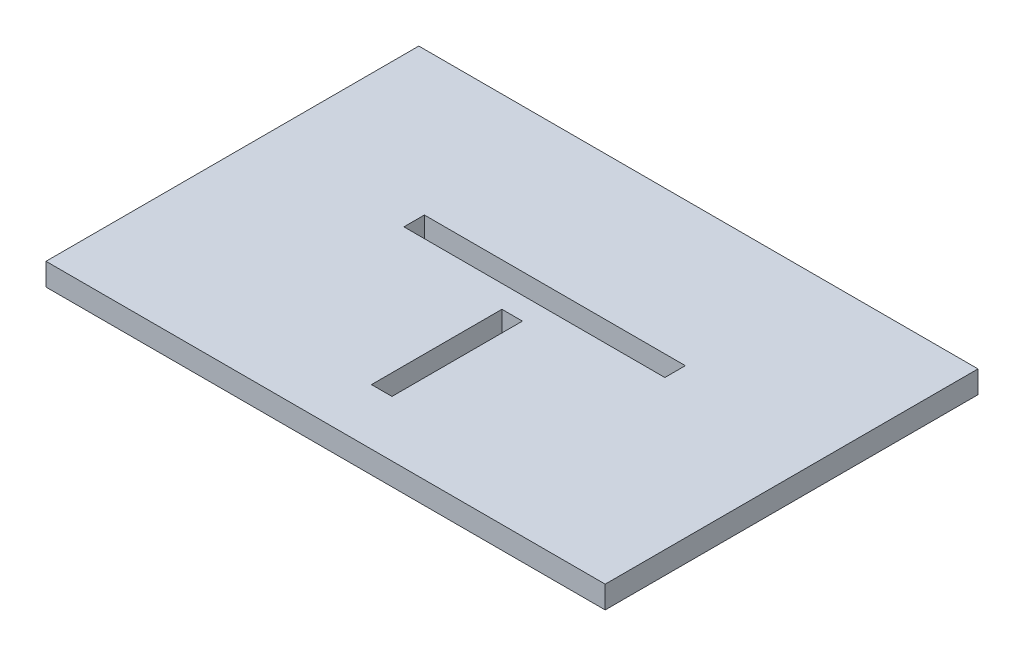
ISO-10303-21;
HEADER;
FILE_DESCRIPTION(('STEP AP214'),'2;1');
FILE_NAME('part.step','',(''),(''),'','','');
FILE_SCHEMA(('AUTOMOTIVE_DESIGN { 1 0 10303 214 1 1 1 1 }'));
ENDSEC;
DATA;
#1=APPLICATION_CONTEXT('core data for automotive mechanical design processes');
#2=APPLICATION_PROTOCOL_DEFINITION('international standard','automotive_design',2000,#1);
#3=PRODUCT_CONTEXT('',#1,'mechanical');
#4=PRODUCT('Part','Part','',(#3));
#5=PRODUCT_RELATED_PRODUCT_CATEGORY('part','',(#4));
#6=PRODUCT_DEFINITION_FORMATION('','',#4);
#7=PRODUCT_DEFINITION_CONTEXT('part definition',#1,'design');
#8=PRODUCT_DEFINITION('design','',#6,#7);
#9=PRODUCT_DEFINITION_SHAPE('','',#8);
#10=(LENGTH_UNIT() NAMED_UNIT(*) SI_UNIT(.MILLI.,.METRE.));
#11=(NAMED_UNIT(*) PLANE_ANGLE_UNIT() SI_UNIT($,.RADIAN.));
#12=(NAMED_UNIT(*) SI_UNIT($,.STERADIAN.) SOLID_ANGLE_UNIT());
#13=UNCERTAINTY_MEASURE_WITH_UNIT(LENGTH_MEASURE(1.E-05),#10,'distance_accuracy_value','');
#14=(GEOMETRIC_REPRESENTATION_CONTEXT(3) GLOBAL_UNCERTAINTY_ASSIGNED_CONTEXT((#13)) GLOBAL_UNIT_ASSIGNED_CONTEXT((#10,
#11,#12)) REPRESENTATION_CONTEXT('',''));
#15=CARTESIAN_POINT('',(0.,0.,0.));
#16=DIRECTION('',(0.,0.,1.));
#17=DIRECTION('',(1.,0.,0.));
#18=AXIS2_PLACEMENT_3D('',#15,#16,#17);
#19=CARTESIAN_POINT('',(0.,6.,0.));
#20=DIRECTION('',(0.,1.,0.));
#21=DIRECTION('',(0.,0.,1.));
#22=AXIS2_PLACEMENT_3D('',#19,#20,#21);
#23=PLANE('',#22);
#24=DIRECTION('',(0.,0.,-1.));
#25=VECTOR('',#24,1.);
#26=CARTESIAN_POINT('',(75.,6.,-50.));
#27=LINE('',#26,#25);
#28=CARTESIAN_POINT('',(75.,6.,50.));
#29=VERTEX_POINT('',#28);
#30=CARTESIAN_POINT('',(75.,6.,-50.));
#31=VERTEX_POINT('',#30);
#32=EDGE_CURVE('E193',#29,#31,#27,.T.);
#33=ORIENTED_EDGE('',*,*,#32,.T.);
#34=DIRECTION('',(-1.,0.,0.));
#35=VECTOR('',#34,1.);
#36=CARTESIAN_POINT('',(-75.,6.,-50.));
#37=LINE('',#36,#35);
#38=CARTESIAN_POINT('',(-75.,6.,-50.));
#39=VERTEX_POINT('',#38);
#40=EDGE_CURVE('E196',#31,#39,#37,.T.);
#41=ORIENTED_EDGE('',*,*,#40,.T.);
#42=DIRECTION('',(0.,0.,1.));
#43=VECTOR('',#42,1.);
#44=CARTESIAN_POINT('',(-75.,6.,-50.));
#45=LINE('',#44,#43);
#46=CARTESIAN_POINT('',(-75.,6.,50.));
#47=VERTEX_POINT('',#46);
#48=EDGE_CURVE('E199',#39,#47,#45,.T.);
#49=ORIENTED_EDGE('',*,*,#48,.T.);
#50=DIRECTION('',(1.,0.,0.));
#51=VECTOR('',#50,1.);
#52=CARTESIAN_POINT('',(-75.,6.,50.));
#53=LINE('',#52,#51);
#54=EDGE_CURVE('E201',#47,#29,#53,.T.);
#55=ORIENTED_EDGE('',*,*,#54,.T.);
#56=EDGE_LOOP('',(#33,#41,#49,#55));
#57=FACE_BOUND('',#56,.T.);
#58=DIRECTION('',(-1.,0.,0.));
#59=VECTOR('',#58,1.);
#60=CARTESIAN_POINT('',(-2.7,6.,0.));
#61=LINE('',#60,#59);
#62=CARTESIAN_POINT('',(2.79999999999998,6.,0.));
#63=VERTEX_POINT('',#62);
#64=CARTESIAN_POINT('',(-2.7,6.,0.));
#65=VERTEX_POINT('',#64);
#66=EDGE_CURVE('E164',#63,#65,#61,.T.);
#67=ORIENTED_EDGE('',*,*,#66,.F.);
#68=DIRECTION('',(0.,0.,-1.));
#69=VECTOR('',#68,1.);
#70=CARTESIAN_POINT('',(2.79999999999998,6.,0.));
#71=LINE('',#70,#69);
#72=CARTESIAN_POINT('',(2.8,6.,35.));
#73=VERTEX_POINT('',#72);
#74=EDGE_CURVE('E162',#73,#63,#71,.T.);
#75=ORIENTED_EDGE('',*,*,#74,.F.);
#76=DIRECTION('',(1.,0.,0.));
#77=VECTOR('',#76,1.);
#78=CARTESIAN_POINT('',(-2.7,6.,35.));
#79=LINE('',#78,#77);
#80=CARTESIAN_POINT('',(-2.7,6.,35.));
#81=VERTEX_POINT('',#80);
#82=EDGE_CURVE('E170',#81,#73,#79,.T.);
#83=ORIENTED_EDGE('',*,*,#82,.F.);
#84=DIRECTION('',(0.,0.,1.));
#85=VECTOR('',#84,1.);
#86=CARTESIAN_POINT('',(-2.7,6.,0.));
#87=LINE('',#86,#85);
#88=EDGE_CURVE('E167',#65,#81,#87,.T.);
#89=ORIENTED_EDGE('',*,*,#88,.F.);
#90=EDGE_LOOP('',(#67,#75,#83,#89));
#91=FACE_BOUND('',#90,.T.);
#92=DIRECTION('',(-1.,0.,0.));
#93=VECTOR('',#92,1.);
#94=CARTESIAN_POINT('',(-35.,6.,-11.5));
#95=LINE('',#94,#93);
#96=CARTESIAN_POINT('',(35.,6.,-11.5));
#97=VERTEX_POINT('',#96);
#98=CARTESIAN_POINT('',(-35.,6.,-11.5));
#99=VERTEX_POINT('',#98);
#100=EDGE_CURVE('E134',#97,#99,#95,.T.);
#101=ORIENTED_EDGE('',*,*,#100,.F.);
#102=DIRECTION('',(0.,0.,-1.));
#103=VECTOR('',#102,1.);
#104=CARTESIAN_POINT('',(35.,6.,-11.5));
#105=LINE('',#104,#103);
#106=CARTESIAN_POINT('',(35.,6.,-6.));
#107=VERTEX_POINT('',#106);
#108=EDGE_CURVE('E126',#107,#97,#105,.T.);
#109=ORIENTED_EDGE('',*,*,#108,.F.);
#110=DIRECTION('',(1.,0.,0.));
#111=VECTOR('',#110,1.);
#112=CARTESIAN_POINT('',(-35.,6.,-5.99999999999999));
#113=LINE('',#112,#111);
#114=CARTESIAN_POINT('',(-35.,6.,-5.99999999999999));
#115=VERTEX_POINT('',#114);
#116=EDGE_CURVE('E148',#115,#107,#113,.T.);
#117=ORIENTED_EDGE('',*,*,#116,.F.);
#118=DIRECTION('',(0.,0.,1.));
#119=VECTOR('',#118,1.);
#120=CARTESIAN_POINT('',(-35.,6.,-11.5));
#121=LINE('',#120,#119);
#122=EDGE_CURVE('E146',#99,#115,#121,.T.);
#123=ORIENTED_EDGE('',*,*,#122,.F.);
#124=EDGE_LOOP('',(#101,#109,#117,#123));
#125=FACE_BOUND('',#124,.T.);
#126=ADVANCED_FACE('F37',(#57,#91,#125),#23,.T.);
#127=CARTESIAN_POINT('',(0.,0.,0.));
#128=DIRECTION('',(0.,1.,0.));
#129=DIRECTION('',(0.,0.,1.));
#130=AXIS2_PLACEMENT_3D('',#127,#128,#129);
#131=PLANE('',#130);
#132=DIRECTION('',(0.,0.,-1.));
#133=VECTOR('',#132,1.);
#134=CARTESIAN_POINT('',(2.79999999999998,0.,0.));
#135=LINE('',#134,#133);
#136=CARTESIAN_POINT('',(2.8,0.,35.));
#137=VERTEX_POINT('',#136);
#138=CARTESIAN_POINT('',(2.79999999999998,0.,0.));
#139=VERTEX_POINT('',#138);
#140=EDGE_CURVE('E142',#137,#139,#135,.T.);
#141=ORIENTED_EDGE('',*,*,#140,.T.);
#142=DIRECTION('',(-1.,0.,0.));
#143=VECTOR('',#142,1.);
#144=CARTESIAN_POINT('',(-2.7,0.,0.));
#145=LINE('',#144,#143);
#146=CARTESIAN_POINT('',(-2.7,0.,0.));
#147=VERTEX_POINT('',#146);
#148=EDGE_CURVE('E175',#139,#147,#145,.T.);
#149=ORIENTED_EDGE('',*,*,#148,.T.);
#150=DIRECTION('',(0.,0.,1.));
#151=VECTOR('',#150,1.);
#152=CARTESIAN_POINT('',(-2.7,0.,0.));
#153=LINE('',#152,#151);
#154=CARTESIAN_POINT('',(-2.7,0.,35.));
#155=VERTEX_POINT('',#154);
#156=EDGE_CURVE('E178',#147,#155,#153,.T.);
#157=ORIENTED_EDGE('',*,*,#156,.T.);
#158=DIRECTION('',(1.,0.,0.));
#159=VECTOR('',#158,1.);
#160=CARTESIAN_POINT('',(-2.7,0.,35.));
#161=LINE('',#160,#159);
#162=EDGE_CURVE('E165',#155,#137,#161,.T.);
#163=ORIENTED_EDGE('',*,*,#162,.T.);
#164=EDGE_LOOP('',(#141,#149,#157,#163));
#165=FACE_BOUND('',#164,.T.);
#166=DIRECTION('',(0.,0.,-1.));
#167=VECTOR('',#166,1.);
#168=CARTESIAN_POINT('',(75.,0.,-50.));
#169=LINE('',#168,#167);
#170=CARTESIAN_POINT('',(75.,0.,50.));
#171=VERTEX_POINT('',#170);
#172=CARTESIAN_POINT('',(75.,0.,-50.));
#173=VERTEX_POINT('',#172);
#174=EDGE_CURVE('E192',#171,#173,#169,.T.);
#175=ORIENTED_EDGE('',*,*,#174,.F.);
#176=DIRECTION('',(1.,0.,0.));
#177=VECTOR('',#176,1.);
#178=CARTESIAN_POINT('',(-75.,0.,50.));
#179=LINE('',#178,#177);
#180=CARTESIAN_POINT('',(-75.,0.,50.));
#181=VERTEX_POINT('',#180);
#182=EDGE_CURVE('E197',#181,#171,#179,.T.);
#183=ORIENTED_EDGE('',*,*,#182,.F.);
#184=DIRECTION('',(0.,0.,1.));
#185=VECTOR('',#184,1.);
#186=CARTESIAN_POINT('',(-75.,0.,-50.));
#187=LINE('',#186,#185);
#188=CARTESIAN_POINT('',(-75.,0.,-50.));
#189=VERTEX_POINT('',#188);
#190=EDGE_CURVE('E208',#189,#181,#187,.T.);
#191=ORIENTED_EDGE('',*,*,#190,.F.);
#192=DIRECTION('',(-1.,0.,0.));
#193=VECTOR('',#192,1.);
#194=CARTESIAN_POINT('',(-75.,0.,-50.));
#195=LINE('',#194,#193);
#196=EDGE_CURVE('E206',#173,#189,#195,.T.);
#197=ORIENTED_EDGE('',*,*,#196,.F.);
#198=EDGE_LOOP('',(#175,#183,#191,#197));
#199=FACE_BOUND('',#198,.T.);
#200=DIRECTION('',(0.,0.,-1.));
#201=VECTOR('',#200,1.);
#202=CARTESIAN_POINT('',(35.,0.,-11.5));
#203=LINE('',#202,#201);
#204=CARTESIAN_POINT('',(35.,0.,-6.));
#205=VERTEX_POINT('',#204);
#206=CARTESIAN_POINT('',(35.,0.,-11.5));
#207=VERTEX_POINT('',#206);
#208=EDGE_CURVE('E60',#205,#207,#203,.T.);
#209=ORIENTED_EDGE('',*,*,#208,.T.);
#210=DIRECTION('',(-1.,0.,0.));
#211=VECTOR('',#210,1.);
#212=CARTESIAN_POINT('',(-35.,0.,-11.5));
#213=LINE('',#212,#211);
#214=CARTESIAN_POINT('',(-35.,0.,-11.5));
#215=VERTEX_POINT('',#214);
#216=EDGE_CURVE('E141',#207,#215,#213,.T.);
#217=ORIENTED_EDGE('',*,*,#216,.T.);
#218=DIRECTION('',(0.,0.,1.));
#219=VECTOR('',#218,1.);
#220=CARTESIAN_POINT('',(-35.,0.,-11.5));
#221=LINE('',#220,#219);
#222=CARTESIAN_POINT('',(-35.,0.,-5.99999999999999));
#223=VERTEX_POINT('',#222);
#224=EDGE_CURVE('E154',#215,#223,#221,.T.);
#225=ORIENTED_EDGE('',*,*,#224,.T.);
#226=DIRECTION('',(1.,0.,0.));
#227=VECTOR('',#226,1.);
#228=CARTESIAN_POINT('',(-35.,0.,-5.99999999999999));
#229=LINE('',#228,#227);
#230=EDGE_CURVE('E135',#223,#205,#229,.T.);
#231=ORIENTED_EDGE('',*,*,#230,.T.);
#232=EDGE_LOOP('',(#209,#217,#225,#231));
#233=FACE_BOUND('',#232,.T.);
#234=ADVANCED_FACE('F226',(#165,#199,#233),#131,.F.);
#235=CARTESIAN_POINT('',(75.,6.,-50.));
#236=DIRECTION('',(-1.,0.,0.));
#237=DIRECTION('',(0.,0.,1.));
#238=AXIS2_PLACEMENT_3D('',#235,#236,#237);
#239=PLANE('',#238);
#240=ORIENTED_EDGE('',*,*,#174,.T.);
#241=DIRECTION('',(0.,-1.,0.));
#242=VECTOR('',#241,1.);
#243=CARTESIAN_POINT('',(75.,6.,-50.));
#244=LINE('',#243,#242);
#245=EDGE_CURVE('E11',#31,#173,#244,.T.);
#246=ORIENTED_EDGE('',*,*,#245,.F.);
#247=ORIENTED_EDGE('',*,*,#32,.F.);
#248=DIRECTION('',(0.,-1.,0.));
#249=VECTOR('',#248,1.);
#250=CARTESIAN_POINT('',(75.,6.,50.));
#251=LINE('',#250,#249);
#252=EDGE_CURVE('E203',#29,#171,#251,.T.);
#253=ORIENTED_EDGE('',*,*,#252,.T.);
#254=EDGE_LOOP('',(#240,#246,#247,#253));
#255=FACE_BOUND('',#254,.T.);
#256=ADVANCED_FACE('F39',(#255),#239,.F.);
#257=CARTESIAN_POINT('',(-75.,6.,-50.));
#258=DIRECTION('',(0.,0.,1.));
#259=DIRECTION('',(1.,0.,0.));
#260=AXIS2_PLACEMENT_3D('',#257,#258,#259);
#261=PLANE('',#260);
#262=ORIENTED_EDGE('',*,*,#196,.T.);
#263=DIRECTION('',(0.,-1.,0.));
#264=VECTOR('',#263,1.);
#265=CARTESIAN_POINT('',(-75.,6.,-50.));
#266=LINE('',#265,#264);
#267=EDGE_CURVE('E45',#39,#189,#266,.T.);
#268=ORIENTED_EDGE('',*,*,#267,.F.);
#269=ORIENTED_EDGE('',*,*,#40,.F.);
#270=ORIENTED_EDGE('',*,*,#245,.T.);
#271=EDGE_LOOP('',(#262,#268,#269,#270));
#272=FACE_BOUND('',#271,.T.);
#273=ADVANCED_FACE('F237',(#272),#261,.F.);
#274=CARTESIAN_POINT('',(-75.,6.,-50.));
#275=DIRECTION('',(1.,0.,0.));
#276=DIRECTION('',(0.,0.,-1.));
#277=AXIS2_PLACEMENT_3D('',#274,#275,#276);
#278=PLANE('',#277);
#279=ORIENTED_EDGE('',*,*,#190,.T.);
#280=DIRECTION('',(0.,-1.,0.));
#281=VECTOR('',#280,1.);
#282=CARTESIAN_POINT('',(-75.,6.,50.));
#283=LINE('',#282,#281);
#284=EDGE_CURVE('E213',#47,#181,#283,.T.);
#285=ORIENTED_EDGE('',*,*,#284,.F.);
#286=ORIENTED_EDGE('',*,*,#48,.F.);
#287=ORIENTED_EDGE('',*,*,#267,.T.);
#288=EDGE_LOOP('',(#279,#285,#286,#287));
#289=FACE_BOUND('',#288,.T.);
#290=ADVANCED_FACE('F220',(#289),#278,.F.);
#291=CARTESIAN_POINT('',(-75.,6.,50.));
#292=DIRECTION('',(0.,0.,-1.));
#293=DIRECTION('',(-1.,0.,0.));
#294=AXIS2_PLACEMENT_3D('',#291,#292,#293);
#295=PLANE('',#294);
#296=ORIENTED_EDGE('',*,*,#182,.T.);
#297=ORIENTED_EDGE('',*,*,#252,.F.);
#298=ORIENTED_EDGE('',*,*,#54,.F.);
#299=ORIENTED_EDGE('',*,*,#284,.T.);
#300=EDGE_LOOP('',(#296,#297,#298,#299));
#301=FACE_BOUND('',#300,.T.);
#302=ADVANCED_FACE('F230',(#301),#295,.F.);
#303=CARTESIAN_POINT('',(2.79999999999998,6.,0.));
#304=DIRECTION('',(-1.,0.,0.));
#305=DIRECTION('',(0.,0.,1.));
#306=AXIS2_PLACEMENT_3D('',#303,#304,#305);
#307=PLANE('',#306);
#308=ORIENTED_EDGE('',*,*,#140,.F.);
#309=DIRECTION('',(0.,-1.,0.));
#310=VECTOR('',#309,1.);
#311=CARTESIAN_POINT('',(2.8,6.,35.));
#312=LINE('',#311,#310);
#313=EDGE_CURVE('E172',#73,#137,#312,.T.);
#314=ORIENTED_EDGE('',*,*,#313,.F.);
#315=ORIENTED_EDGE('',*,*,#74,.T.);
#316=DIRECTION('',(0.,-1.,0.));
#317=VECTOR('',#316,1.);
#318=CARTESIAN_POINT('',(2.79999999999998,6.,0.));
#319=LINE('',#318,#317);
#320=EDGE_CURVE('E189',#63,#139,#319,.T.);
#321=ORIENTED_EDGE('',*,*,#320,.T.);
#322=EDGE_LOOP('',(#308,#314,#315,#321));
#323=FACE_BOUND('',#322,.T.);
#324=ADVANCED_FACE('F252',(#323),#307,.T.);
#325=CARTESIAN_POINT('',(-2.7,6.,0.));
#326=DIRECTION('',(0.,0.,1.));
#327=DIRECTION('',(1.,0.,0.));
#328=AXIS2_PLACEMENT_3D('',#325,#326,#327);
#329=PLANE('',#328);
#330=ORIENTED_EDGE('',*,*,#148,.F.);
#331=ORIENTED_EDGE('',*,*,#320,.F.);
#332=ORIENTED_EDGE('',*,*,#66,.T.);
#333=DIRECTION('',(0.,-1.,0.));
#334=VECTOR('',#333,1.);
#335=CARTESIAN_POINT('',(-2.7,6.,0.));
#336=LINE('',#335,#334);
#337=EDGE_CURVE('E187',#65,#147,#336,.T.);
#338=ORIENTED_EDGE('',*,*,#337,.T.);
#339=EDGE_LOOP('',(#330,#331,#332,#338));
#340=FACE_BOUND('',#339,.T.);
#341=ADVANCED_FACE('F259',(#340),#329,.T.);
#342=CARTESIAN_POINT('',(-2.7,6.,0.));
#343=DIRECTION('',(1.,0.,0.));
#344=DIRECTION('',(0.,0.,-1.));
#345=AXIS2_PLACEMENT_3D('',#342,#343,#344);
#346=PLANE('',#345);
#347=ORIENTED_EDGE('',*,*,#156,.F.);
#348=ORIENTED_EDGE('',*,*,#337,.F.);
#349=ORIENTED_EDGE('',*,*,#88,.T.);
#350=DIRECTION('',(0.,-1.,0.));
#351=VECTOR('',#350,1.);
#352=CARTESIAN_POINT('',(-2.7,6.,35.));
#353=LINE('',#352,#351);
#354=EDGE_CURVE('E185',#81,#155,#353,.T.);
#355=ORIENTED_EDGE('',*,*,#354,.T.);
#356=EDGE_LOOP('',(#347,#348,#349,#355));
#357=FACE_BOUND('',#356,.T.);
#358=ADVANCED_FACE('F264',(#357),#346,.T.);
#359=CARTESIAN_POINT('',(-2.7,6.,35.));
#360=DIRECTION('',(0.,0.,-1.));
#361=DIRECTION('',(-1.,0.,0.));
#362=AXIS2_PLACEMENT_3D('',#359,#360,#361);
#363=PLANE('',#362);
#364=ORIENTED_EDGE('',*,*,#162,.F.);
#365=ORIENTED_EDGE('',*,*,#354,.F.);
#366=ORIENTED_EDGE('',*,*,#82,.T.);
#367=ORIENTED_EDGE('',*,*,#313,.T.);
#368=EDGE_LOOP('',(#364,#365,#366,#367));
#369=FACE_BOUND('',#368,.T.);
#370=ADVANCED_FACE('F271',(#369),#363,.T.);
#371=CARTESIAN_POINT('',(35.,6.,-11.5));
#372=DIRECTION('',(-1.,0.,0.));
#373=DIRECTION('',(0.,0.,1.));
#374=AXIS2_PLACEMENT_3D('',#371,#372,#373);
#375=PLANE('',#374);
#376=ORIENTED_EDGE('',*,*,#208,.F.);
#377=DIRECTION('',(0.,-1.,0.));
#378=VECTOR('',#377,1.);
#379=CARTESIAN_POINT('',(35.,6.,-6.));
#380=LINE('',#379,#378);
#381=EDGE_CURVE('E130',#107,#205,#380,.T.);
#382=ORIENTED_EDGE('',*,*,#381,.F.);
#383=ORIENTED_EDGE('',*,*,#108,.T.);
#384=DIRECTION('',(0.,-1.,0.));
#385=VECTOR('',#384,1.);
#386=CARTESIAN_POINT('',(35.,6.,-11.5));
#387=LINE('',#386,#385);
#388=EDGE_CURVE('E129',#97,#207,#387,.T.);
#389=ORIENTED_EDGE('',*,*,#388,.T.);
#390=EDGE_LOOP('',(#376,#382,#383,#389));
#391=FACE_BOUND('',#390,.T.);
#392=ADVANCED_FACE('F128',(#391),#375,.T.);
#393=CARTESIAN_POINT('',(-35.,6.,-11.5));
#394=DIRECTION('',(0.,0.,1.));
#395=DIRECTION('',(1.,0.,0.));
#396=AXIS2_PLACEMENT_3D('',#393,#394,#395);
#397=PLANE('',#396);
#398=ORIENTED_EDGE('',*,*,#216,.F.);
#399=ORIENTED_EDGE('',*,*,#388,.F.);
#400=ORIENTED_EDGE('',*,*,#100,.T.);
#401=DIRECTION('',(0.,-1.,0.));
#402=VECTOR('',#401,1.);
#403=CARTESIAN_POINT('',(-35.,6.,-11.5));
#404=LINE('',#403,#402);
#405=EDGE_CURVE('E143',#99,#215,#404,.T.);
#406=ORIENTED_EDGE('',*,*,#405,.T.);
#407=EDGE_LOOP('',(#398,#399,#400,#406));
#408=FACE_BOUND('',#407,.T.);
#409=ADVANCED_FACE('F138',(#408),#397,.T.);
#410=CARTESIAN_POINT('',(-35.,6.,-11.5));
#411=DIRECTION('',(1.,0.,0.));
#412=DIRECTION('',(0.,0.,-1.));
#413=AXIS2_PLACEMENT_3D('',#410,#411,#412);
#414=PLANE('',#413);
#415=ORIENTED_EDGE('',*,*,#224,.F.);
#416=ORIENTED_EDGE('',*,*,#405,.F.);
#417=ORIENTED_EDGE('',*,*,#122,.T.);
#418=DIRECTION('',(0.,-1.,0.));
#419=VECTOR('',#418,1.);
#420=CARTESIAN_POINT('',(-35.,6.,-5.99999999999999));
#421=LINE('',#420,#419);
#422=EDGE_CURVE('E52',#115,#223,#421,.T.);
#423=ORIENTED_EDGE('',*,*,#422,.T.);
#424=EDGE_LOOP('',(#415,#416,#417,#423));
#425=FACE_BOUND('',#424,.T.);
#426=ADVANCED_FACE('F289',(#425),#414,.T.);
#427=CARTESIAN_POINT('',(-35.,6.,-5.99999999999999));
#428=DIRECTION('',(0.,0.,-1.));
#429=DIRECTION('',(-1.,0.,0.));
#430=AXIS2_PLACEMENT_3D('',#427,#428,#429);
#431=PLANE('',#430);
#432=ORIENTED_EDGE('',*,*,#230,.F.);
#433=ORIENTED_EDGE('',*,*,#422,.F.);
#434=ORIENTED_EDGE('',*,*,#116,.T.);
#435=ORIENTED_EDGE('',*,*,#381,.T.);
#436=EDGE_LOOP('',(#432,#433,#434,#435));
#437=FACE_BOUND('',#436,.T.);
#438=ADVANCED_FACE('F292',(#437),#431,.T.);
#439=CLOSED_SHELL('',(#126,#234,#256,#273,#290,#302,#324,#341,#358,#370,#392,#409,#426,#438));
#440=MANIFOLD_SOLID_BREP('B2',#439);
#441=ADVANCED_BREP_SHAPE_REPRESENTATION('',(#18,#440),#14);
#442=SHAPE_DEFINITION_REPRESENTATION(#9,#441);
ENDSEC;
END-ISO-10303-21;
